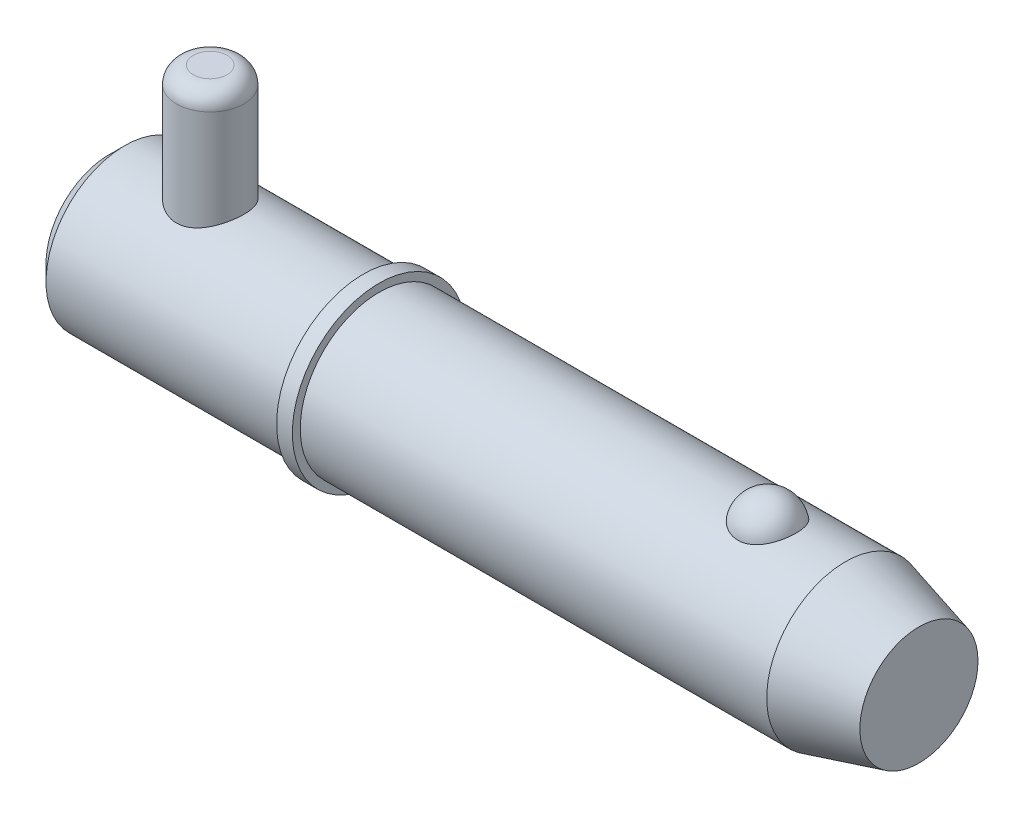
ISO-10303-21;
HEADER;
FILE_DESCRIPTION(('STEP AP214'),'2;1');
FILE_NAME('part.step','',(''),(''),'','','');
FILE_SCHEMA(('AUTOMOTIVE_DESIGN { 1 0 10303 214 1 1 1 1 }'));
ENDSEC;
DATA;
#1=APPLICATION_CONTEXT('core data for automotive mechanical design processes');
#2=APPLICATION_PROTOCOL_DEFINITION('international standard','automotive_design',2000,#1);
#3=PRODUCT_CONTEXT('',#1,'mechanical');
#4=PRODUCT('Part','Part','',(#3));
#5=PRODUCT_RELATED_PRODUCT_CATEGORY('part','',(#4));
#6=PRODUCT_DEFINITION_FORMATION('','',#4);
#7=PRODUCT_DEFINITION_CONTEXT('part definition',#1,'design');
#8=PRODUCT_DEFINITION('design','',#6,#7);
#9=PRODUCT_DEFINITION_SHAPE('','',#8);
#10=(LENGTH_UNIT() NAMED_UNIT(*) SI_UNIT(.MILLI.,.METRE.));
#11=(NAMED_UNIT(*) PLANE_ANGLE_UNIT() SI_UNIT($,.RADIAN.));
#12=(NAMED_UNIT(*) SI_UNIT($,.STERADIAN.) SOLID_ANGLE_UNIT());
#13=UNCERTAINTY_MEASURE_WITH_UNIT(LENGTH_MEASURE(1.E-05),#10,'distance_accuracy_value','');
#14=(GEOMETRIC_REPRESENTATION_CONTEXT(3) GLOBAL_UNCERTAINTY_ASSIGNED_CONTEXT((#13)) GLOBAL_UNIT_ASSIGNED_CONTEXT((#10,
#11,#12)) REPRESENTATION_CONTEXT('',''));
#15=CARTESIAN_POINT('',(0.,0.,0.));
#16=DIRECTION('',(0.,0.,1.));
#17=DIRECTION('',(1.,0.,0.));
#18=AXIS2_PLACEMENT_3D('',#15,#16,#17);
#19=CARTESIAN_POINT('',(14.28,26.985,0.));
#20=DIRECTION('',(0.,-1.,0.));
#21=DIRECTION('',(0.,0.,-1.));
#22=AXIS2_PLACEMENT_3D('',#19,#20,#21);
#23=CYLINDRICAL_SURFACE('',#22,4.76);
#24=CARTESIAN_POINT('',(14.28,-8.73500000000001,0.));
#25=DIRECTION('',(0.,1.,0.));
#26=DIRECTION('',(0.,0.,1.));
#27=AXIS2_PLACEMENT_3D('',#24,#25,#26);
#28=CIRCLE('',#27,4.76);
#29=CARTESIAN_POINT('',(14.28,-8.73500000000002,-4.76));
#30=VERTEX_POINT('',#29);
#31=EDGE_CURVE('P0_E25',#30,#30,#28,.T.);
#32=CARTESIAN_POINT('',(14.28,24.605,0.));
#33=DIRECTION('',(0.,1.,0.));
#34=DIRECTION('',(0.,0.,1.));
#35=AXIS2_PLACEMENT_3D('',#32,#33,#34);
#36=CIRCLE('',#35,4.76);
#37=CARTESIAN_POINT('',(14.28,24.605,-4.76));
#38=VERTEX_POINT('',#37);
#39=EDGE_CURVE('P0_E29',#38,#38,#36,.F.);
#40=CARTESIAN_POINT('',(14.28,-8.73500000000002,-4.76));
#41=CARTESIAN_POINT('',(14.28,-8.38770833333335,-4.76));
#42=CARTESIAN_POINT('',(14.28,-8.04041666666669,-4.76));
#43=CARTESIAN_POINT('',(14.28,-7.34583333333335,-4.76));
#44=CARTESIAN_POINT('',(14.28,-6.99854166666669,-4.76));
#45=CARTESIAN_POINT('',(14.28,-6.30395833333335,-4.76));
#46=CARTESIAN_POINT('',(14.28,-5.95666666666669,-4.76));
#47=CARTESIAN_POINT('',(14.28,-5.26208333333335,-4.76));
#48=CARTESIAN_POINT('',(14.28,-4.91479166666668,-4.76));
#49=CARTESIAN_POINT('',(14.28,-4.22020833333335,-4.76));
#50=CARTESIAN_POINT('',(14.28,-3.87291666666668,-4.76));
#51=CARTESIAN_POINT('',(14.28,-3.17833333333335,-4.76));
#52=CARTESIAN_POINT('',(14.28,-2.83104166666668,-4.76));
#53=CARTESIAN_POINT('',(14.28,-2.13645833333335,-4.76));
#54=CARTESIAN_POINT('',(14.28,-1.78916666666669,-4.76));
#55=CARTESIAN_POINT('',(14.28,-1.09458333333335,-4.76));
#56=CARTESIAN_POINT('',(14.28,-0.747291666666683,-4.76));
#57=CARTESIAN_POINT('',(14.28,-0.052708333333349,-4.76));
#58=CARTESIAN_POINT('',(14.28,0.294583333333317,-4.76));
#59=CARTESIAN_POINT('',(14.28,0.989166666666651,-4.76));
#60=CARTESIAN_POINT('',(14.28,1.33645833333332,-4.76));
#61=CARTESIAN_POINT('',(14.28,2.03104166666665,-4.76));
#62=CARTESIAN_POINT('',(14.28,2.37833333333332,-4.76));
#63=CARTESIAN_POINT('',(14.28,3.07291666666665,-4.76));
#64=CARTESIAN_POINT('',(14.28,3.42020833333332,-4.76));
#65=CARTESIAN_POINT('',(14.28,4.11479166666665,-4.76));
#66=CARTESIAN_POINT('',(14.28,4.46208333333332,-4.76));
#67=CARTESIAN_POINT('',(14.28,5.15666666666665,-4.76));
#68=CARTESIAN_POINT('',(14.28,5.50395833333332,-4.76));
#69=CARTESIAN_POINT('',(14.28,6.19854166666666,-4.76));
#70=CARTESIAN_POINT('',(14.28,6.54583333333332,-4.76));
#71=CARTESIAN_POINT('',(14.28,7.24041666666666,-4.76));
#72=CARTESIAN_POINT('',(14.28,7.58770833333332,-4.76));
#73=CARTESIAN_POINT('',(14.28,8.28229166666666,-4.76));
#74=CARTESIAN_POINT('',(14.28,8.62958333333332,-4.76));
#75=CARTESIAN_POINT('',(14.28,9.32416666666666,-4.76));
#76=CARTESIAN_POINT('',(14.28,9.67145833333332,-4.76));
#77=CARTESIAN_POINT('',(14.28,10.3660416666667,-4.76));
#78=CARTESIAN_POINT('',(14.28,10.7133333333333,-4.76));
#79=CARTESIAN_POINT('',(14.28,11.4079166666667,-4.76));
#80=CARTESIAN_POINT('',(14.28,11.7552083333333,-4.76));
#81=CARTESIAN_POINT('',(14.28,12.4497916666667,-4.76));
#82=CARTESIAN_POINT('',(14.28,12.7970833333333,-4.76));
#83=CARTESIAN_POINT('',(14.28,13.4916666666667,-4.76));
#84=CARTESIAN_POINT('',(14.28,13.8389583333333,-4.76));
#85=CARTESIAN_POINT('',(14.28,14.5335416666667,-4.76));
#86=CARTESIAN_POINT('',(14.28,14.8808333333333,-4.76));
#87=CARTESIAN_POINT('',(14.28,15.5754166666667,-4.76));
#88=CARTESIAN_POINT('',(14.28,15.9227083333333,-4.76));
#89=CARTESIAN_POINT('',(14.28,16.6172916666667,-4.76));
#90=CARTESIAN_POINT('',(14.28,16.9645833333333,-4.76));
#91=CARTESIAN_POINT('',(14.28,17.6591666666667,-4.76));
#92=CARTESIAN_POINT('',(14.28,18.0064583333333,-4.76));
#93=CARTESIAN_POINT('',(14.28,18.7010416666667,-4.76));
#94=CARTESIAN_POINT('',(14.28,19.0483333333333,-4.76));
#95=CARTESIAN_POINT('',(14.28,19.7429166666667,-4.76));
#96=CARTESIAN_POINT('',(14.28,20.0902083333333,-4.76));
#97=CARTESIAN_POINT('',(14.28,20.7847916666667,-4.76));
#98=CARTESIAN_POINT('',(14.28,21.1320833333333,-4.76));
#99=CARTESIAN_POINT('',(14.28,21.8266666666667,-4.76));
#100=CARTESIAN_POINT('',(14.28,22.1739583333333,-4.76));
#101=CARTESIAN_POINT('',(14.28,22.8685416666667,-4.76));
#102=CARTESIAN_POINT('',(14.28,23.2158333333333,-4.76));
#103=CARTESIAN_POINT('',(14.28,23.9104166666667,-4.76));
#104=CARTESIAN_POINT('',(14.28,24.2577083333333,-4.76));
#105=CARTESIAN_POINT('',(14.28,24.605,-4.76));
#106=B_SPLINE_CURVE_WITH_KNOTS('',3,(#40,#41,#42,#43,#44,#45,#46,#47,#48,#49,#50,#51,#52,#53,
#54,#55,#56,#57,#58,#59,#60,#61,#62,#63,#64,#65,#66,#67,#68,#69,#70,#71,#72,#73,#74,#75,#76,#77,
#78,#79,#80,#81,#82,#83,#84,#85,#86,#87,#88,#89,#90,#91,#92,#93,#94,#95,#96,#97,#98,#99,#100,
#101,#102,#103,#104,#105),.UNSPECIFIED.,.F.,.F.,(4,2,2,2,2,2,2,2,2,2,2,2,2,2,2,2,2,2,2,2,2,2,2,
2,2,2,2,2,2,2,2,2,4),(0.,1.041875,2.08375,3.125625,4.1675,5.209375,6.25125,7.293125,
8.33500000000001,9.376875,10.41875,11.460625,12.5025,13.544375,14.58625,15.628125,16.67,
17.711875,18.75375,19.795625,20.8375,21.879375,22.92125,23.963125,25.005,26.046875,27.08875,
28.130625,29.1725,30.214375,31.25625,32.298125,33.34),.UNSPECIFIED.);
#107=EDGE_CURVE('P0_BSEAM14',#30,#38,#106,.T.);
#108=ORIENTED_EDGE('',*,*,#31,.T.);
#109=ORIENTED_EDGE('',*,*,#39,.T.);
#110=ORIENTED_EDGE('',*,*,#107,.T.);
#111=ORIENTED_EDGE('',*,*,#107,.F.);
#112=EDGE_LOOP('',(#108,#110,#109,#111));
#113=FACE_BOUND('',#112,.T.);
#114=ADVANCED_FACE('P0_F14',(#113),#23,.T.);
#115=CARTESIAN_POINT('',(14.28,26.985,0.));
#116=DIRECTION('',(0.,1.,0.));
#117=DIRECTION('',(0.,0.,1.));
#118=AXIS2_PLACEMENT_3D('',#115,#116,#117);
#119=PLANE('',#118);
#120=CARTESIAN_POINT('',(14.28,26.985,0.));
#121=DIRECTION('',(0.,1.,0.));
#122=DIRECTION('',(0.,0.,1.));
#123=AXIS2_PLACEMENT_3D('',#120,#121,#122);
#124=CIRCLE('',#123,2.38);
#125=CARTESIAN_POINT('',(14.28,26.985,2.38));
#126=VERTEX_POINT('',#125);
#127=EDGE_CURVE('P0_E10',#126,#126,#124,.T.);
#128=ORIENTED_EDGE('',*,*,#127,.T.);
#129=EDGE_LOOP('',(#128));
#130=FACE_BOUND('',#129,.T.);
#131=ADVANCED_FACE('P0_F46',(#130),#119,.T.);
#132=CARTESIAN_POINT('',(14.28,-11.115,0.));
#133=DIRECTION('',(0.,1.,0.));
#134=DIRECTION('',(0.,0.,1.));
#135=AXIS2_PLACEMENT_3D('',#132,#133,#134);
#136=PLANE('',#135);
#137=CARTESIAN_POINT('',(14.28,-11.115,0.));
#138=DIRECTION('',(0.,1.,0.));
#139=DIRECTION('',(0.,0.,1.));
#140=AXIS2_PLACEMENT_3D('',#137,#138,#139);
#141=CIRCLE('',#140,2.38);
#142=CARTESIAN_POINT('',(14.28,-11.115,2.38));
#143=VERTEX_POINT('',#142);
#144=EDGE_CURVE('P0_E21',#143,#143,#141,.F.);
#145=ORIENTED_EDGE('',*,*,#144,.T.);
#146=EDGE_LOOP('',(#145));
#147=FACE_BOUND('',#146,.T.);
#148=ADVANCED_FACE('P0_F43',(#147),#136,.F.);
#149=CARTESIAN_POINT('',(14.28,-8.735,0.));
#150=DIRECTION('',(0.,1.,0.));
#151=DIRECTION('',(0.,0.,1.));
#152=AXIS2_PLACEMENT_3D('',#149,#150,#151);
#153=DEGENERATE_TOROIDAL_SURFACE('',#152,2.38,2.38,.T.);
#154=ORIENTED_EDGE('',*,*,#144,.F.);
#155=EDGE_LOOP('',(#154));
#156=FACE_BOUND('',#155,.T.);
#157=ORIENTED_EDGE('',*,*,#31,.F.);
#158=EDGE_LOOP('',(#157));
#159=FACE_BOUND('',#158,.T.);
#160=ADVANCED_FACE('P0_F38',(#156,#159),#153,.T.);
#161=CARTESIAN_POINT('',(14.28,24.605,0.));
#162=DIRECTION('',(0.,1.,0.));
#163=DIRECTION('',(0.,0.,1.));
#164=AXIS2_PLACEMENT_3D('',#161,#162,#163);
#165=DEGENERATE_TOROIDAL_SURFACE('',#164,2.38,2.38,.T.);
#166=ORIENTED_EDGE('',*,*,#39,.F.);
#167=EDGE_LOOP('',(#166));
#168=FACE_BOUND('',#167,.T.);
#169=ORIENTED_EDGE('',*,*,#127,.F.);
#170=EDGE_LOOP('',(#169));
#171=FACE_BOUND('',#170,.T.);
#172=ADVANCED_FACE('P0_F16',(#168,#171),#165,.T.);
#173=CLOSED_SHELL('',(#114,#131,#148,#160,#172));
#174=MANIFOLD_SOLID_BREP('P0_B1',#173);
#175=CARTESIAN_POINT('',(0.,0.,0.));
#176=DIRECTION('',(1.,0.,0.));
#177=DIRECTION('',(0.,0.,-1.));
#178=AXIS2_PLACEMENT_3D('',#175,#176,#177);
#179=CYLINDRICAL_SURFACE('',#178,11.115);
#180=CARTESIAN_POINT('',(103.929563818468,0.,0.));
#181=DIRECTION('',(1.,0.,0.));
#182=DIRECTION('',(0.,0.,-1.));
#183=AXIS2_PLACEMENT_3D('',#180,#181,#182);
#184=CIRCLE('',#183,11.115);
#185=CARTESIAN_POINT('',(103.929563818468,0.,-11.115));
#186=VERTEX_POINT('',#185);
#187=EDGE_CURVE('P1_E81',#186,#186,#184,.T.);
#188=ORIENTED_EDGE('',*,*,#187,.F.);
#189=EDGE_LOOP('',(#188));
#190=FACE_BOUND('',#189,.T.);
#191=CARTESIAN_POINT('',(38.1,0.,0.));
#192=DIRECTION('',(1.,0.,0.));
#193=DIRECTION('',(0.,0.,-1.));
#194=AXIS2_PLACEMENT_3D('',#191,#192,#193);
#195=CIRCLE('',#194,11.115);
#196=CARTESIAN_POINT('',(38.1,0.,-11.115));
#197=VERTEX_POINT('',#196);
#198=EDGE_CURVE('P1_E85',#197,#197,#195,.T.);
#199=ORIENTED_EDGE('',*,*,#198,.T.);
#200=EDGE_LOOP('',(#199));
#201=FACE_BOUND('',#200,.T.);
#202=CARTESIAN_POINT('',(92.9310680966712,10.3028087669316,4.17077409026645));
#203=CARTESIAN_POINT('',(92.7147756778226,10.3028003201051,4.17078240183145));
#204=CARTESIAN_POINT('',(92.4985488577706,10.3098895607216,4.15340593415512));
#205=CARTESIAN_POINT('',(92.0725408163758,10.3373834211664,4.08449540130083));
#206=CARTESIAN_POINT('',(91.8627577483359,10.3577841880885,4.03297121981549));
#207=CARTESIAN_POINT('',(91.4557825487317,10.4095237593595,3.89746513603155));
#208=CARTESIAN_POINT('',(91.2585726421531,10.4408466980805,3.81353029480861));
#209=CARTESIAN_POINT('',(90.8813382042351,10.5110236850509,3.61560339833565));
#210=CARTESIAN_POINT('',(90.7013171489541,10.5498792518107,3.50160528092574));
#211=CARTESIAN_POINT('',(90.3576842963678,10.6322884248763,3.24292464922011));
#212=CARTESIAN_POINT('',(90.1946861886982,10.6759443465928,3.09746040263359));
#213=CARTESIAN_POINT('',(89.8945911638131,10.7625291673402,2.78171925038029));
#214=CARTESIAN_POINT('',(89.7574990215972,10.8054579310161,2.61143778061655));
#215=CARTESIAN_POINT('',(89.5064084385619,10.8881935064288,2.24226695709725));
#216=CARTESIAN_POINT('',(89.3937105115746,10.9277761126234,2.04244123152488));
#217=CARTESIAN_POINT('',(89.2017771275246,10.997484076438,1.62578254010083));
#218=CARTESIAN_POINT('',(89.1225446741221,11.0276085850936,1.40894804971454));
#219=CARTESIAN_POINT('',(88.9983034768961,11.0756732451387,0.961250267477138));
#220=CARTESIAN_POINT('',(88.953760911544,11.0934470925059,0.730239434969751));
#221=CARTESIAN_POINT('',(88.9015695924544,11.1143331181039,0.263439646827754));
#222=CARTESIAN_POINT('',(88.8939200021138,11.1174456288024,0.0276507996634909));
#223=CARTESIAN_POINT('',(88.9156105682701,11.1087161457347,-0.440729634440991));
#224=CARTESIAN_POINT('',(88.9447624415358,11.0969502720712,-0.673331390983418));
#225=CARTESIAN_POINT('',(89.0391432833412,11.0597872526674,-1.12996621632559));
#226=CARTESIAN_POINT('',(89.1043729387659,11.0343898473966,-1.35399912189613));
#227=CARTESIAN_POINT('',(89.2696984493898,10.972515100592,-1.78750286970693));
#228=CARTESIAN_POINT('',(89.3698386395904,10.9360236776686,-1.99695478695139));
#229=CARTESIAN_POINT('',(89.6029408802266,10.8557595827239,-2.3952066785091));
#230=CARTESIAN_POINT('',(89.7359054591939,10.8119863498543,-2.5840050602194));
#231=CARTESIAN_POINT('',(90.032407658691,10.7216733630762,-2.93635726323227));
#232=CARTESIAN_POINT('',(90.1960565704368,10.675123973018,-3.09981510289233));
#233=CARTESIAN_POINT('',(90.5498601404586,10.5846571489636,-3.39592247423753));
#234=CARTESIAN_POINT('',(90.7400123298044,10.5407394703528,-3.52857487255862));
#235=CARTESIAN_POINT('',(91.1375014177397,10.4616690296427,-3.75646057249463));
#236=CARTESIAN_POINT('',(91.3443670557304,10.4263443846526,-3.85245432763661));
#237=CARTESIAN_POINT('',(91.7729541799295,10.3675574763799,-4.00798747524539));
#238=CARTESIAN_POINT('',(91.994670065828,10.3440907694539,-4.06754052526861));
#239=CARTESIAN_POINT('',(92.4346695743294,10.3128282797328,-4.14614314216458));
#240=CARTESIAN_POINT('',(92.6525654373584,10.3043040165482,-4.1670783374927));
#241=CARTESIAN_POINT('',(93.08894951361,10.3016771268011,-4.17357158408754));
#242=CARTESIAN_POINT('',(93.3074376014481,10.3075716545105,-4.15913661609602));
#243=CARTESIAN_POINT('',(93.7317442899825,10.3326686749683,-4.09636961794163));
#244=CARTESIAN_POINT('',(93.9377458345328,10.3514555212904,-4.0490957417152));
#245=CARTESIAN_POINT('',(94.3385764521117,10.399818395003,-3.92320197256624));
#246=CARTESIAN_POINT('',(94.5334046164,10.4293952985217,-3.84457953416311));
#247=CARTESIAN_POINT('',(94.9111917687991,10.4969600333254,-3.65612410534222));
#248=CARTESIAN_POINT('',(95.0937974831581,10.5351178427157,-3.54564545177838));
#249=CARTESIAN_POINT('',(95.4382040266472,10.6154999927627,-3.29718036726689));
#250=CARTESIAN_POINT('',(95.600000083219,10.657725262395,-3.15918764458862));
#251=CARTESIAN_POINT('',(95.9069596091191,10.744212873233,-2.85163580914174));
#252=CARTESIAN_POINT('',(96.0508919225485,10.7884718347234,-2.68084605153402));
#253=CARTESIAN_POINT('',(96.3092371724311,10.872374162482,-2.3172186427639));
#254=CARTESIAN_POINT('',(96.4236448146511,10.9120167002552,-2.12437704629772));
#255=CARTESIAN_POINT('',(96.6238739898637,10.9838919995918,-1.71516999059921));
#256=CARTESIAN_POINT('',(96.7086617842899,11.0158465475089,-1.49824866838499));
#257=CARTESIAN_POINT('',(96.8426838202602,11.0673523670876,-1.05228572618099));
#258=CARTESIAN_POINT('',(96.8919174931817,11.086903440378,-0.823243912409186));
#259=CARTESIAN_POINT('',(96.9538915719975,11.1116323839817,-0.359087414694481));
#260=CARTESIAN_POINT('',(96.9665662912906,11.1167843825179,-0.123962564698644));
#261=CARTESIAN_POINT('',(96.954973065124,11.1121144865,0.345220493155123));
#262=CARTESIAN_POINT('',(96.9307056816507,11.1022928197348,0.579278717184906));
#263=CARTESIAN_POINT('',(96.8459073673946,11.0687504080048,1.03866534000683));
#264=CARTESIAN_POINT('',(96.7855299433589,11.0450885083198,1.26402641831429));
#265=CARTESIAN_POINT('',(96.6298532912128,10.9863185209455,1.70076772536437));
#266=CARTESIAN_POINT('',(96.534551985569,10.9512097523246,1.91214712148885));
#267=CARTESIAN_POINT('',(96.3103974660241,10.8729733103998,2.31608359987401));
#268=CARTESIAN_POINT('',(96.1813806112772,10.8298068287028,2.50854240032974));
#269=CARTESIAN_POINT('',(95.8927327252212,10.7401896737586,2.86808766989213));
#270=CARTESIAN_POINT('',(95.7331022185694,10.6937390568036,3.03517457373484));
#271=CARTESIAN_POINT('',(95.3875341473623,10.6029321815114,3.33857581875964));
#272=CARTESIAN_POINT('',(95.2017089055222,10.5585680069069,3.47501541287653));
#273=CARTESIAN_POINT('',(94.8078750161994,10.4769321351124,3.71390897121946));
#274=CARTESIAN_POINT('',(94.5998635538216,10.439661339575,3.81635861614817));
#275=CARTESIAN_POINT('',(94.1540666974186,10.3749407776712,3.98910631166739));
#276=CARTESIAN_POINT('',(93.9152342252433,10.3482457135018,4.05700929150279));
#277=CARTESIAN_POINT('',(93.4279254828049,10.312188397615,4.14782844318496));
#278=CARTESIAN_POINT('',(93.1794535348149,10.3028184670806,4.17076454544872));
#279=CARTESIAN_POINT('',(92.9310680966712,10.3028087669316,4.17077409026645));
#280=B_SPLINE_CURVE_WITH_KNOTS('',3,(#202,#203,#204,#205,#206,#207,#208,#209,#210,#211,#212,
#213,#214,#215,#216,#217,#218,#219,#220,#221,#222,#223,#224,#225,#226,#227,#228,#229,#230,#231,
#232,#233,#234,#235,#236,#237,#238,#239,#240,#241,#242,#243,#244,#245,#246,#247,#248,#249,#250,
#251,#252,#253,#254,#255,#256,#257,#258,#259,#260,#261,#262,#263,#264,#265,#266,#267,#268,#269,
#270,#271,#272,#273,#274,#275,#276,#277,#278,#279),.UNSPECIFIED.,.T.,.F.,(4,2,2,2,2,2,2,2,2,2,2,
2,2,2,2,2,2,2,2,2,2,2,2,2,2,2,2,2,2,2,2,2,2,2,2,2,2,2,4),(0.,0.647966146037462,1.29574482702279,
1.94258643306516,2.58955857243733,3.25496465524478,3.92049326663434,4.61566368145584,
5.31089647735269,6.01531821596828,6.71972398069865,7.42054043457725,8.12137023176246,
8.82309331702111,9.52487047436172,10.2292439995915,10.9335519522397,11.6223330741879,
12.3108558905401,12.9647664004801,13.6185478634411,14.2521847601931,14.8858731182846,
15.5334360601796,16.1811472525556,16.8611459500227,17.5412664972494,18.2431855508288,
18.9451158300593,19.6483065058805,20.3514864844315,21.0516982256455,21.7519516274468,
22.4556690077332,23.1593743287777,23.8601491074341,24.5610129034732,25.3054529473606,
26.049562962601),.UNSPECIFIED.);
#281=CARTESIAN_POINT('',(92.9310680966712,10.3028087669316,4.17077409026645));
#282=VERTEX_POINT('',#281);
#283=EDGE_CURVE('P1_E35',#282,#282,#280,.T.);
#284=ORIENTED_EDGE('',*,*,#283,.T.);
#285=EDGE_LOOP('',(#284));
#286=FACE_BOUND('',#285,.T.);
#287=ADVANCED_FACE('P1_F13',(#190,#201,#286),#179,.T.);
#288=CARTESIAN_POINT('',(0.,0.,0.));
#289=DIRECTION('',(-1.,0.,0.));
#290=DIRECTION('',(0.,0.,1.));
#291=AXIS2_PLACEMENT_3D('',#288,#289,#290);
#292=PLANE('',#291);
#293=CARTESIAN_POINT('',(0.,0.,0.));
#294=DIRECTION('',(1.,0.,0.));
#295=DIRECTION('',(0.,0.,-1.));
#296=AXIS2_PLACEMENT_3D('',#293,#294,#295);
#297=CIRCLE('',#296,8.892);
#298=CARTESIAN_POINT('',(0.,0.,-8.892));
#299=VERTEX_POINT('',#298);
#300=EDGE_CURVE('P1_E9',#299,#299,#297,.T.);
#301=ORIENTED_EDGE('',*,*,#300,.F.);
#302=EDGE_LOOP('',(#301));
#303=FACE_BOUND('',#302,.T.);
#304=ADVANCED_FACE('P1_F15',(#303),#292,.T.);
#305=CARTESIAN_POINT('',(2.22299999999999,0.,0.));
#306=DIRECTION('',(1.,0.,0.));
#307=DIRECTION('',(0.,0.,-1.));
#308=AXIS2_PLACEMENT_3D('',#305,#306,#307);
#309=CONICAL_SURFACE('',#308,11.115,0.78539816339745);
#310=ORIENTED_EDGE('',*,*,#300,.T.);
#311=EDGE_LOOP('',(#310));
#312=FACE_BOUND('',#311,.T.);
#313=CARTESIAN_POINT('',(2.22299999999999,0.,0.));
#314=DIRECTION('',(1.,0.,0.));
#315=DIRECTION('',(0.,0.,-1.));
#316=AXIS2_PLACEMENT_3D('',#313,#314,#315);
#317=CIRCLE('',#316,11.115);
#318=CARTESIAN_POINT('',(2.22299999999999,0.,-11.115));
#319=VERTEX_POINT('',#318);
#320=EDGE_CURVE('P1_E26',#319,#319,#317,.T.);
#321=ORIENTED_EDGE('',*,*,#320,.F.);
#322=EDGE_LOOP('',(#321));
#323=FACE_BOUND('',#322,.T.);
#324=ADVANCED_FACE('P1_F77',(#312,#323),#309,.T.);
#325=CARTESIAN_POINT('',(0.,0.,0.));
#326=DIRECTION('',(1.,0.,0.));
#327=DIRECTION('',(0.,0.,-1.));
#328=AXIS2_PLACEMENT_3D('',#325,#326,#327);
#329=CYLINDRICAL_SURFACE('',#328,11.115);
#330=CARTESIAN_POINT('',(14.28,-10.0441836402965,4.76));
#331=CARTESIAN_POINT('',(14.1533731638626,-10.0441846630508,4.75999904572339));
#332=CARTESIAN_POINT('',(14.0267055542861,-10.0465865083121,4.75493985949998));
#333=CARTESIAN_POINT('',(13.774298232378,-10.0561141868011,4.73475585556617));
#334=CARTESIAN_POINT('',(13.6485591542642,-10.0632429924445,4.71962470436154));
#335=CARTESIAN_POINT('',(13.3987500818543,-10.0819979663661,4.67942666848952));
#336=CARTESIAN_POINT('',(13.2746840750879,-10.0936334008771,4.65433930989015));
#337=CARTESIAN_POINT('',(13.0293244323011,-10.1210146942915,4.59449317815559));
#338=CARTESIAN_POINT('',(12.9080319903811,-10.1367622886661,4.55973032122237));
#339=CARTESIAN_POINT('',(12.669614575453,-10.1717810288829,4.48106435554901));
#340=CARTESIAN_POINT('',(12.5524727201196,-10.1910352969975,4.4372048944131));
#341=CARTESIAN_POINT('',(12.3224300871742,-10.2325403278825,4.34063417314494));
#342=CARTESIAN_POINT('',(12.2095309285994,-10.2547922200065,4.28791957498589));
#343=CARTESIAN_POINT('',(11.8782785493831,-10.3250879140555,4.11715127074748));
#344=CARTESIAN_POINT('',(11.6670799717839,-10.3767168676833,3.98637638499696));
#345=CARTESIAN_POINT('',(11.2564039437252,-10.4874309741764,3.68567149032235));
#346=CARTESIAN_POINT('',(11.0583793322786,-10.5467772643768,3.51386978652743));
#347=CARTESIAN_POINT('',(10.6927724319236,-10.6641377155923,3.13969960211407));
#348=CARTESIAN_POINT('',(10.5252022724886,-10.7221513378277,2.93731900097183));
#349=CARTESIAN_POINT('',(10.2965609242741,-10.8050020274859,2.60935726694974));
#350=CARTESIAN_POINT('',(10.2227768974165,-10.8324811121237,2.49310321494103));
#351=CARTESIAN_POINT('',(10.0853380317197,-10.884703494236,2.25418999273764));
#352=CARTESIAN_POINT('',(10.0216789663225,-10.9094479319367,2.13153352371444));
#353=CARTESIAN_POINT('',(9.90506238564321,-10.9554932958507,1.88060370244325));
#354=CARTESIAN_POINT('',(9.85210574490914,-10.9767939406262,1.7523298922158));
#355=CARTESIAN_POINT('',(9.75746464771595,-11.0153112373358,1.49115740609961));
#356=CARTESIAN_POINT('',(9.71577447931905,-11.0325299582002,1.35826111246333));
#357=CARTESIAN_POINT('',(9.64605475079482,-11.0615607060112,1.09614539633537));
#358=CARTESIAN_POINT('',(9.61740732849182,-11.0736151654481,0.96711700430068));
#359=CARTESIAN_POINT('',(9.57092026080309,-11.0932687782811,0.706847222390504));
#360=CARTESIAN_POINT('',(9.55307574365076,-11.1008699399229,0.575606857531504));
#361=CARTESIAN_POINT('',(9.52838640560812,-11.1114054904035,0.31192917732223));
#362=CARTESIAN_POINT('',(9.52153986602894,-11.114340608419,0.179492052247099));
#363=CARTESIAN_POINT('',(9.51892405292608,-11.1154607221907,-0.0855090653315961));
#364=CARTESIAN_POINT('',(9.52315432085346,-11.1136459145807,-0.218073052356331));
#365=CARTESIAN_POINT('',(9.542009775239,-11.1055891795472,-0.473709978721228));
#366=CARTESIAN_POINT('',(9.55594693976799,-11.099640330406,-0.596843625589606));
#367=CARTESIAN_POINT('',(9.59332832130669,-11.0837823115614,-0.841440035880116));
#368=CARTESIAN_POINT('',(9.61677567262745,-11.0738718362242,-0.962902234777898));
#369=CARTESIAN_POINT('',(9.67294089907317,-11.0503378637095,-1.20325684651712));
#370=CARTESIAN_POINT('',(9.70565569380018,-11.0367156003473,-1.32215009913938));
#371=CARTESIAN_POINT('',(9.78005008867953,-11.0060908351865,-1.55666640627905));
#372=CARTESIAN_POINT('',(9.82173311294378,-10.9890870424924,-1.67228819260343));
#373=CARTESIAN_POINT('',(9.96110379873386,-10.9330280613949,-2.01656166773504));
#374=CARTESIAN_POINT('',(10.0722987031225,-10.8892801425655,-2.23915547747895));
#375=CARTESIAN_POINT('',(10.3268588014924,-10.7934745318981,-2.66299199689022));
#376=CARTESIAN_POINT('',(10.4702355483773,-10.7414138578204,-2.86422700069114));
#377=CARTESIAN_POINT('',(10.7973904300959,-10.6296201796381,-3.25557775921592));
#378=CARTESIAN_POINT('',(10.9833705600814,-10.569604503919,-3.443774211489));
#379=CARTESIAN_POINT('',(11.3844486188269,-10.4514707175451,-3.78722133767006));
#380=CARTESIAN_POINT('',(11.5995590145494,-10.3933534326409,-3.94245783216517));
#381=CARTESIAN_POINT('',(11.9444340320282,-10.311516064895,-4.14990014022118));
#382=CARTESIAN_POINT('',(12.0654579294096,-10.2847012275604,-4.21573894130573));
#383=CARTESIAN_POINT('',(12.3132718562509,-10.2342051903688,-4.33688518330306));
#384=CARTESIAN_POINT('',(12.4400593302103,-10.2105226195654,-4.39219723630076));
#385=CARTESIAN_POINT('',(12.6985418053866,-10.1671237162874,-4.49174500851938));
#386=CARTESIAN_POINT('',(12.8302359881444,-10.1474067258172,-4.53598256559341));
#387=CARTESIAN_POINT('',(13.0975061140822,-10.1126841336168,-4.61287629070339));
#388=CARTESIAN_POINT('',(13.233079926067,-10.0976759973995,-4.64553869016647));
#389=CARTESIAN_POINT('',(13.4978553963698,-10.0737863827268,-4.6971059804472));
#390=CARTESIAN_POINT('',(13.6268754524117,-10.0645618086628,-4.716785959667));
#391=CARTESIAN_POINT('',(13.8862990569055,-10.051062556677,-4.74548419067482));
#392=CARTESIAN_POINT('',(14.0167019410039,-10.0467856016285,-4.75450734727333));
#393=CARTESIAN_POINT('',(14.277859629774,-10.0433352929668,-4.76179143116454));
#394=CARTESIAN_POINT('',(14.4086143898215,-10.0441613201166,-4.76005366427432));
#395=CARTESIAN_POINT('',(14.6694025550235,-10.0508838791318,-4.74584231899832));
#396=CARTESIAN_POINT('',(14.7994359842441,-10.0567802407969,-4.73336910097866));
#397=CARTESIAN_POINT('',(15.0487369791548,-10.0728449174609,-4.69907984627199));
#398=CARTESIAN_POINT('',(15.1681238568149,-10.0826872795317,-4.67797462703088));
#399=CARTESIAN_POINT('',(15.4045894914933,-10.1062580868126,-4.62682977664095));
#400=CARTESIAN_POINT('',(15.5216674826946,-10.1199877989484,-4.59678723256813));
#401=CARTESIAN_POINT('',(15.868278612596,-10.1664161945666,-4.49365911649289));
#402=CARTESIAN_POINT('',(16.0933756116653,-10.2043671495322,-4.40754694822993));
#403=CARTESIAN_POINT('',(16.5357981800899,-10.2919879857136,-4.19898201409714));
#404=CARTESIAN_POINT('',(16.7523611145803,-10.3420954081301,-4.07511281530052));
#405=CARTESIAN_POINT('',(17.1627188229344,-10.4477911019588,-3.7959429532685));
#406=CARTESIAN_POINT('',(17.3565033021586,-10.5033818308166,-3.64062816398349));
#407=CARTESIAN_POINT('',(17.7334034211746,-10.6196376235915,-3.28693729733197));
#408=CARTESIAN_POINT('',(17.9141276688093,-10.6803237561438,-3.08599175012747));
#409=CARTESIAN_POINT('',(18.1582189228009,-10.7666348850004,-2.76320365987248));
#410=CARTESIAN_POINT('',(18.2351223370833,-10.7946346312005,-2.65197124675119));
#411=CARTESIAN_POINT('',(18.3793967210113,-10.8483267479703,-2.42297927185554));
#412=CARTESIAN_POINT('',(18.4467718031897,-10.87402011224,-2.30522255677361));
#413=CARTESIAN_POINT('',(18.5717669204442,-10.9225249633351,-2.06324665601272));
#414=CARTESIAN_POINT('',(18.6293326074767,-10.9453202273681,-1.93899615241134));
#415=CARTESIAN_POINT('',(18.73370006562,-10.9872100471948,-1.6855059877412));
#416=CARTESIAN_POINT('',(18.7805065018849,-11.0063062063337,-1.55626851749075));
#417=CARTESIAN_POINT('',(18.8628731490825,-11.0402419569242,-1.29375150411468));
#418=CARTESIAN_POINT('',(18.8984366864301,-11.0550828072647,-1.16047316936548));
#419=CARTESIAN_POINT('',(18.9579183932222,-11.0800638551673,-0.890912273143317));
#420=CARTESIAN_POINT('',(18.9818374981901,-11.0902044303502,-0.75462995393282));
#421=CARTESIAN_POINT('',(19.0164177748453,-11.104911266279,-0.490295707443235));
#422=CARTESIAN_POINT('',(19.027922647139,-11.1098318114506,-0.362373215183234));
#423=CARTESIAN_POINT('',(19.040554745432,-11.1152360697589,-0.105876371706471));
#424=CARTESIAN_POINT('',(19.0416784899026,-11.1157182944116,0.0226981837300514));
#425=CARTESIAN_POINT('',(19.0335275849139,-11.1122291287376,0.27938352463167));
#426=CARTESIAN_POINT('',(19.0242587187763,-11.1082602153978,0.407494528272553));
#427=CARTESIAN_POINT('',(18.9954320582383,-11.0959792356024,0.662388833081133));
#428=CARTESIAN_POINT('',(18.9758704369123,-11.0876655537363,0.789171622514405));
#429=CARTESIAN_POINT('',(18.9276379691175,-11.0673259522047,1.03545890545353));
#430=CARTESIAN_POINT('',(18.8993573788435,-11.0554596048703,1.15505309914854));
#431=CARTESIAN_POINT('',(18.8337694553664,-11.0282166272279,1.39134516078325));
#432=CARTESIAN_POINT('',(18.7964589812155,-11.0128387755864,1.5080420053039));
#433=CARTESIAN_POINT('',(18.671464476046,-10.9619666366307,1.85262797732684));
#434=CARTESIAN_POINT('',(18.5706772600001,-10.9217161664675,2.07521484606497));
#435=CARTESIAN_POINT('',(18.33202463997,-10.8301378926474,2.51061719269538));
#436=CARTESIAN_POINT('',(18.1926775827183,-10.7783885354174,2.72252375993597));
#437=CARTESIAN_POINT('',(17.8829747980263,-10.669863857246,3.12088015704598));
#438=CARTESIAN_POINT('',(17.7126068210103,-10.6130865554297,3.30731987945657));
#439=CARTESIAN_POINT('',(17.3310036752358,-10.495668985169,3.66358491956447));
#440=CARTESIAN_POINT('',(17.1177010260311,-10.4350471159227,3.83122543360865));
#441=CARTESIAN_POINT('',(16.7778915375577,-10.3495418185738,4.05420569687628));
#442=CARTESIAN_POINT('',(16.6612023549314,-10.3219229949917,4.12383380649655));
#443=CARTESIAN_POINT('',(16.4218466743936,-10.2693487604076,4.25306463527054));
#444=CARTESIAN_POINT('',(16.2991829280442,-10.2443921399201,4.31267191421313));
#445=CARTESIAN_POINT('',(16.0488008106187,-10.1979981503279,4.42126071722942));
#446=CARTESIAN_POINT('',(15.9210894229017,-10.1765561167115,4.47025635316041));
#447=CARTESIAN_POINT('',(15.6613937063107,-10.1379191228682,4.55720152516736));
#448=CARTESIAN_POINT('',(15.5294115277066,-10.1207220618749,4.59515652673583));
#449=CARTESIAN_POINT('',(15.2624981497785,-10.091252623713,4.65951684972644));
#450=CARTESIAN_POINT('',(15.1275757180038,-10.0789672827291,4.68595259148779));
#451=CARTESIAN_POINT('',(14.8556442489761,-10.0597530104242,4.72706206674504));
#452=CARTESIAN_POINT('',(14.7186368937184,-10.0528199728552,4.74174481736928));
#453=CARTESIAN_POINT('',(14.5310955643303,-10.047196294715,4.75363843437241));
#454=CARTESIAN_POINT('',(14.48091543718,-10.0460674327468,4.75602323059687));
#455=CARTESIAN_POINT('',(14.3804923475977,-10.044560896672,4.7592042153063));
#456=CARTESIAN_POINT('',(14.3302493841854,-10.0441832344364,4.76000037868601));
#457=CARTESIAN_POINT('',(14.28,-10.0441836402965,4.76));
#458=B_SPLINE_CURVE_WITH_KNOTS('',3,(#330,#331,#332,#333,#334,#335,#336,#337,#338,#339,#340,
#341,#342,#343,#344,#345,#346,#347,#348,#349,#350,#351,#352,#353,#354,#355,#356,#357,#358,#359,
#360,#361,#362,#363,#364,#365,#366,#367,#368,#369,#370,#371,#372,#373,#374,#375,#376,#377,#378,
#379,#380,#381,#382,#383,#384,#385,#386,#387,#388,#389,#390,#391,#392,#393,#394,#395,#396,#397,
#398,#399,#400,#401,#402,#403,#404,#405,#406,#407,#408,#409,#410,#411,#412,#413,#414,#415,#416,
#417,#418,#419,#420,#421,#422,#423,#424,#425,#426,#427,#428,#429,#430,#431,#432,#433,#434,#435,
#436,#437,#438,#439,#440,#441,#442,#443,#444,#445,#446,#447,#448,#449,#450,#451,#452,#453,#454,
#455,#456,#457),.UNSPECIFIED.,.T.,.F.,(4,2,2,2,2,2,2,2,2,2,2,2,2,2,2,2,2,2,2,2,2,2,2,2,2,2,2,2,
2,2,2,2,2,2,2,2,2,2,2,2,2,2,2,2,2,2,2,2,2,2,2,2,2,2,2,2,2,2,2,2,2,2,2,4),(0.,0.379828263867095,
0.759895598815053,1.14074858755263,1.52176256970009,1.90098898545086,2.28035867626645,
3.03818035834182,3.84125131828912,4.6446414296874,5.06541657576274,5.48601561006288,
5.90664899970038,6.3270687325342,6.72470503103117,7.12216187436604,7.51955659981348,
7.91693487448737,8.28868404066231,8.66055582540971,9.03230414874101,9.40419465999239,
10.1585834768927,10.9132435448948,11.7236471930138,12.5343987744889,12.9550196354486,
13.3754557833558,13.7958221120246,14.2159617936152,14.6079540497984,14.9997658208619,
15.3915300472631,15.7832811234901,16.1477615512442,16.512360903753,17.240999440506,
18.0012974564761,18.761937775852,19.5886929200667,20.0025782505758,20.4162843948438,
20.832212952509,21.2479608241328,21.6635855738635,22.0791769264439,22.4642880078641,
22.8495282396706,23.2345541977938,23.6197234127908,23.9896813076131,24.3597680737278,
25.099327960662,25.8726239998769,26.6462260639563,27.4759193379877,27.8914891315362,
28.3068693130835,28.7216936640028,29.1363123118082,29.5498292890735,29.9630287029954,
30.113753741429,30.2644811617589),.UNSPECIFIED.);
#459=CARTESIAN_POINT('',(14.28,-10.0441836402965,4.76));
#460=VERTEX_POINT('',#459);
#461=EDGE_CURVE('P1_E17',#460,#460,#458,.T.);
#462=ORIENTED_EDGE('',*,*,#461,.F.);
#463=EDGE_LOOP('',(#462));
#464=FACE_BOUND('',#463,.T.);
#465=CARTESIAN_POINT('',(14.28,10.0441836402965,4.76));
#466=CARTESIAN_POINT('',(14.4066268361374,10.0441846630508,4.75999904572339));
#467=CARTESIAN_POINT('',(14.5332944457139,10.0465865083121,4.75493985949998));
#468=CARTESIAN_POINT('',(14.785701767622,10.0561141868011,4.73475585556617));
#469=CARTESIAN_POINT('',(14.9114408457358,10.0632429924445,4.71962470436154));
#470=CARTESIAN_POINT('',(15.1612499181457,10.0819979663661,4.67942666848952));
#471=CARTESIAN_POINT('',(15.2853159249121,10.0936334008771,4.65433930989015));
#472=CARTESIAN_POINT('',(15.5306755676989,10.1210146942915,4.59449317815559));
#473=CARTESIAN_POINT('',(15.6519680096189,10.1367622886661,4.55973032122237));
#474=CARTESIAN_POINT('',(15.890385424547,10.1717810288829,4.48106435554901));
#475=CARTESIAN_POINT('',(16.0075272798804,10.1910352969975,4.4372048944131));
#476=CARTESIAN_POINT('',(16.2375699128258,10.2325403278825,4.34063417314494));
#477=CARTESIAN_POINT('',(16.3504690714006,10.2547922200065,4.28791957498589));
#478=CARTESIAN_POINT('',(16.6817214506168,10.3250879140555,4.11715127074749));
#479=CARTESIAN_POINT('',(16.8929200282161,10.3767168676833,3.98637638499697));
#480=CARTESIAN_POINT('',(17.3035960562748,10.4874309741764,3.68567149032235));
#481=CARTESIAN_POINT('',(17.5016206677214,10.5467772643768,3.51386978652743));
#482=CARTESIAN_POINT('',(17.8672275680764,10.6641377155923,3.13969960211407));
#483=CARTESIAN_POINT('',(18.0347977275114,10.7221513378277,2.93731900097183));
#484=CARTESIAN_POINT('',(18.2634390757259,10.8050020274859,2.60935726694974));
#485=CARTESIAN_POINT('',(18.3372231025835,10.8324811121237,2.49310321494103));
#486=CARTESIAN_POINT('',(18.4746619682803,10.884703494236,2.25418999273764));
#487=CARTESIAN_POINT('',(18.5383210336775,10.9094479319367,2.13153352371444));
#488=CARTESIAN_POINT('',(18.6549376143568,10.9554932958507,1.88060370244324));
#489=CARTESIAN_POINT('',(18.7078942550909,10.9767939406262,1.75232989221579));
#490=CARTESIAN_POINT('',(18.8025353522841,11.0153112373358,1.4911574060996));
#491=CARTESIAN_POINT('',(18.844225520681,11.0325299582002,1.35826111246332));
#492=CARTESIAN_POINT('',(18.9139452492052,11.0615607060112,1.09614539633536));
#493=CARTESIAN_POINT('',(18.9425926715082,11.0736151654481,0.967117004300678));
#494=CARTESIAN_POINT('',(18.9890797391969,11.0932687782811,0.706847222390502));
#495=CARTESIAN_POINT('',(19.0069242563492,11.1008699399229,0.575606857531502));
#496=CARTESIAN_POINT('',(19.0316135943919,11.1114054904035,0.311929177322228));
#497=CARTESIAN_POINT('',(19.0384601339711,11.114340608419,0.179492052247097));
#498=CARTESIAN_POINT('',(19.0410759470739,11.1154607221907,-0.0855090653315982));
#499=CARTESIAN_POINT('',(19.0368456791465,11.1136459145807,-0.218073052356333));
#500=CARTESIAN_POINT('',(19.017990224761,11.1055891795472,-0.47370997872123));
#501=CARTESIAN_POINT('',(19.004053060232,11.099640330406,-0.596843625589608));
#502=CARTESIAN_POINT('',(18.9666716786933,11.0837823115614,-0.841440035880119));
#503=CARTESIAN_POINT('',(18.9432243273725,11.0738718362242,-0.9629022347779));
#504=CARTESIAN_POINT('',(18.8870591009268,11.0503378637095,-1.20325684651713));
#505=CARTESIAN_POINT('',(18.8543443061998,11.0367156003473,-1.32215009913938));
#506=CARTESIAN_POINT('',(18.7799499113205,11.0060908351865,-1.55666640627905));
#507=CARTESIAN_POINT('',(18.7382668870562,10.9890870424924,-1.67228819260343));
#508=CARTESIAN_POINT('',(18.5988962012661,10.9330280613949,-2.01656166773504));
#509=CARTESIAN_POINT('',(18.4877012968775,10.8892801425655,-2.23915547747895));
#510=CARTESIAN_POINT('',(18.2331411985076,10.7934745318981,-2.66299199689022));
#511=CARTESIAN_POINT('',(18.0897644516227,10.7414138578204,-2.86422700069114));
#512=CARTESIAN_POINT('',(17.7626095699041,10.6296201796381,-3.25557775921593));
#513=CARTESIAN_POINT('',(17.5766294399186,10.569604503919,-3.443774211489));
#514=CARTESIAN_POINT('',(17.1755513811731,10.4514707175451,-3.78722133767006));
#515=CARTESIAN_POINT('',(16.9604409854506,10.3933534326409,-3.94245783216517));
#516=CARTESIAN_POINT('',(16.6155659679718,10.311516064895,-4.14990014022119));
#517=CARTESIAN_POINT('',(16.4945420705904,10.2847012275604,-4.21573894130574));
#518=CARTESIAN_POINT('',(16.2467281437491,10.2342051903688,-4.33688518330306));
#519=CARTESIAN_POINT('',(16.1199406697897,10.2105226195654,-4.39219723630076));
#520=CARTESIAN_POINT('',(15.8614581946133,10.1671237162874,-4.49174500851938));
#521=CARTESIAN_POINT('',(15.7297640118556,10.1474067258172,-4.53598256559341));
#522=CARTESIAN_POINT('',(15.4624938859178,10.1126841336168,-4.61287629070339));
#523=CARTESIAN_POINT('',(15.326920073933,10.0976759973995,-4.64553869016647));
#524=CARTESIAN_POINT('',(15.0621446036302,10.0737863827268,-4.6971059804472));
#525=CARTESIAN_POINT('',(14.9331245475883,10.0645618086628,-4.716785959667));
#526=CARTESIAN_POINT('',(14.6737009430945,10.051062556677,-4.74548419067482));
#527=CARTESIAN_POINT('',(14.543298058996,10.0467856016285,-4.75450734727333));
#528=CARTESIAN_POINT('',(14.2821403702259,10.0433352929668,-4.76179143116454));
#529=CARTESIAN_POINT('',(14.1513856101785,10.0441613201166,-4.76005366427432));
#530=CARTESIAN_POINT('',(13.8905974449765,10.0508838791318,-4.74584231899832));
#531=CARTESIAN_POINT('',(13.7605640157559,10.0567802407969,-4.73336910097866));
#532=CARTESIAN_POINT('',(13.5112630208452,10.0728449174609,-4.69907984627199));
#533=CARTESIAN_POINT('',(13.3918761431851,10.0826872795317,-4.67797462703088));
#534=CARTESIAN_POINT('',(13.1554105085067,10.1062580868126,-4.62682977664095));
#535=CARTESIAN_POINT('',(13.0383325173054,10.1199877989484,-4.59678723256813));
#536=CARTESIAN_POINT('',(12.691721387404,10.1664161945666,-4.49365911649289));
#537=CARTESIAN_POINT('',(12.4666243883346,10.2043671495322,-4.40754694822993));
#538=CARTESIAN_POINT('',(12.0242018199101,10.2919879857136,-4.19898201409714));
#539=CARTESIAN_POINT('',(11.8076388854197,10.3420954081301,-4.07511281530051));
#540=CARTESIAN_POINT('',(11.3972811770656,10.4477911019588,-3.7959429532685));
#541=CARTESIAN_POINT('',(11.2034966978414,10.5033818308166,-3.64062816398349));
#542=CARTESIAN_POINT('',(10.8265965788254,10.6196376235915,-3.28693729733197));
#543=CARTESIAN_POINT('',(10.6458723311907,10.6803237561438,-3.08599175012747));
#544=CARTESIAN_POINT('',(10.4017810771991,10.7666348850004,-2.76320365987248));
#545=CARTESIAN_POINT('',(10.3248776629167,10.7946346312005,-2.65197124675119));
#546=CARTESIAN_POINT('',(10.1806032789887,10.8483267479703,-2.42297927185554));
#547=CARTESIAN_POINT('',(10.1132281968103,10.87402011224,-2.30522255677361));
#548=CARTESIAN_POINT('',(9.98823307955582,10.9225249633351,-2.06324665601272));
#549=CARTESIAN_POINT('',(9.93066739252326,10.9453202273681,-1.93899615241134));
#550=CARTESIAN_POINT('',(9.82629993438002,10.9872100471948,-1.6855059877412));
#551=CARTESIAN_POINT('',(9.77949349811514,11.0063062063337,-1.55626851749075));
#552=CARTESIAN_POINT('',(9.69712685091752,11.0402419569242,-1.29375150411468));
#553=CARTESIAN_POINT('',(9.66156331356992,11.0550828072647,-1.16047316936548));
#554=CARTESIAN_POINT('',(9.60208160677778,11.0800638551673,-0.890912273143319));
#555=CARTESIAN_POINT('',(9.57816250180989,11.0902044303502,-0.754629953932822));
#556=CARTESIAN_POINT('',(9.54358222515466,11.104911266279,-0.490295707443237));
#557=CARTESIAN_POINT('',(9.53207735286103,11.1098318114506,-0.362373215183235));
#558=CARTESIAN_POINT('',(9.51944525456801,11.1152360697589,-0.105876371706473));
#559=CARTESIAN_POINT('',(9.51832151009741,11.1157182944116,0.0226981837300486));
#560=CARTESIAN_POINT('',(9.52647241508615,11.1122291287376,0.279383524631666));
#561=CARTESIAN_POINT('',(9.53574128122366,11.1082602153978,0.407494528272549));
#562=CARTESIAN_POINT('',(9.5645679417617,11.0959792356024,0.662388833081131));
#563=CARTESIAN_POINT('',(9.58412956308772,11.0876655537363,0.789171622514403));
#564=CARTESIAN_POINT('',(9.63236203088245,11.0673259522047,1.03545890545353));
#565=CARTESIAN_POINT('',(9.66064262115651,11.0554596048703,1.15505309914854));
#566=CARTESIAN_POINT('',(9.72623054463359,11.0282166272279,1.39134516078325));
#567=CARTESIAN_POINT('',(9.76354101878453,11.0128387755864,1.5080420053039));
#568=CARTESIAN_POINT('',(9.88853552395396,10.9619666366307,1.85262797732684));
#569=CARTESIAN_POINT('',(9.98932273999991,10.9217161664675,2.07521484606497));
#570=CARTESIAN_POINT('',(10.22797536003,10.8301378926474,2.51061719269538));
#571=CARTESIAN_POINT('',(10.3673224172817,10.7783885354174,2.72252375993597));
#572=CARTESIAN_POINT('',(10.6770252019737,10.669863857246,3.12088015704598));
#573=CARTESIAN_POINT('',(10.8473931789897,10.6130865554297,3.30731987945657));
#574=CARTESIAN_POINT('',(11.2289963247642,10.495668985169,3.66358491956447));
#575=CARTESIAN_POINT('',(11.4422989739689,10.4350471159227,3.83122543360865));
#576=CARTESIAN_POINT('',(11.7821084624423,10.3495418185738,4.05420569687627));
#577=CARTESIAN_POINT('',(11.8987976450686,10.3219229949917,4.12383380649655));
#578=CARTESIAN_POINT('',(12.1381533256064,10.2693487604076,4.25306463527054));
#579=CARTESIAN_POINT('',(12.2608170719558,10.2443921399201,4.31267191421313));
#580=CARTESIAN_POINT('',(12.5111991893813,10.1979981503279,4.42126071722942));
#581=CARTESIAN_POINT('',(12.6389105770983,10.1765561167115,4.47025635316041));
#582=CARTESIAN_POINT('',(12.8986062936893,10.1379191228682,4.55720152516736));
#583=CARTESIAN_POINT('',(13.0305884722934,10.1207220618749,4.59515652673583));
#584=CARTESIAN_POINT('',(13.2975018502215,10.091252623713,4.65951684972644));
#585=CARTESIAN_POINT('',(13.4324242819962,10.0789672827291,4.68595259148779));
#586=CARTESIAN_POINT('',(13.7043557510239,10.0597530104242,4.72706206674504));
#587=CARTESIAN_POINT('',(13.8413631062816,10.0528199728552,4.74174481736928));
#588=CARTESIAN_POINT('',(14.0289044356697,10.047196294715,4.75363843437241));
#589=CARTESIAN_POINT('',(14.07908456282,10.0460674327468,4.75602323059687));
#590=CARTESIAN_POINT('',(14.1795076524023,10.044560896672,4.7592042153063));
#591=CARTESIAN_POINT('',(14.2297506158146,10.0441832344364,4.76000037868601));
#592=CARTESIAN_POINT('',(14.28,10.0441836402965,4.76));
#593=B_SPLINE_CURVE_WITH_KNOTS('',3,(#465,#466,#467,#468,#469,#470,#471,#472,#473,#474,#475,
#476,#477,#478,#479,#480,#481,#482,#483,#484,#485,#486,#487,#488,#489,#490,#491,#492,#493,#494,
#495,#496,#497,#498,#499,#500,#501,#502,#503,#504,#505,#506,#507,#508,#509,#510,#511,#512,#513,
#514,#515,#516,#517,#518,#519,#520,#521,#522,#523,#524,#525,#526,#527,#528,#529,#530,#531,#532,
#533,#534,#535,#536,#537,#538,#539,#540,#541,#542,#543,#544,#545,#546,#547,#548,#549,#550,#551,
#552,#553,#554,#555,#556,#557,#558,#559,#560,#561,#562,#563,#564,#565,#566,#567,#568,#569,#570,
#571,#572,#573,#574,#575,#576,#577,#578,#579,#580,#581,#582,#583,#584,#585,#586,#587,#588,#589,
#590,#591,#592),.UNSPECIFIED.,.T.,.F.,(4,2,2,2,2,2,2,2,2,2,2,2,2,2,2,2,2,2,2,2,2,2,2,2,2,2,2,2,
2,2,2,2,2,2,2,2,2,2,2,2,2,2,2,2,2,2,2,2,2,2,2,2,2,2,2,2,2,2,2,2,2,2,2,4),(0.,0.379828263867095,
0.759895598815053,1.14074858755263,1.52176256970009,1.90098898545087,2.28035867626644,
3.03818035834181,3.84125131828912,4.6446414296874,5.06541657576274,5.48601561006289,
5.90664899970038,6.3270687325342,6.72470503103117,7.12216187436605,7.51955659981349,
7.91693487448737,8.28868404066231,8.66055582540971,9.03230414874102,9.4041946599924,
10.1585834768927,10.9132435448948,11.7236471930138,12.5343987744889,12.9550196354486,
13.3754557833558,13.7958221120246,14.2159617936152,14.6079540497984,14.9997658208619,
15.3915300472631,15.7832811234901,16.1477615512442,16.512360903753,17.240999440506,
18.0012974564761,18.761937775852,19.5886929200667,20.0025782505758,20.4162843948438,
20.832212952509,21.2479608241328,21.6635855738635,22.0791769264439,22.4642880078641,
22.8495282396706,23.2345541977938,23.6197234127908,23.9896813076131,24.3597680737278,
25.099327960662,25.8726239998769,26.6462260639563,27.4759193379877,27.8914891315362,
28.3068693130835,28.7216936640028,29.1363123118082,29.5498292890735,29.9630287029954,
30.113753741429,30.2644811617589),.UNSPECIFIED.);
#594=CARTESIAN_POINT('',(14.28,10.0441836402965,4.76));
#595=VERTEX_POINT('',#594);
#596=EDGE_CURVE('P1_E43',#595,#595,#593,.T.);
#597=ORIENTED_EDGE('',*,*,#596,.F.);
#598=EDGE_LOOP('',(#597));
#599=FACE_BOUND('',#598,.T.);
#600=ORIENTED_EDGE('',*,*,#320,.T.);
#601=EDGE_LOOP('',(#600));
#602=FACE_BOUND('',#601,.T.);
#603=CARTESIAN_POINT('',(35.877,0.,0.));
#604=DIRECTION('',(1.,0.,0.));
#605=DIRECTION('',(0.,0.,-1.));
#606=AXIS2_PLACEMENT_3D('',#603,#604,#605);
#607=CIRCLE('',#606,11.115);
#608=CARTESIAN_POINT('',(35.877,0.,-11.115));
#609=VERTEX_POINT('',#608);
#610=EDGE_CURVE('P1_E31',#609,#609,#607,.T.);
#611=ORIENTED_EDGE('',*,*,#610,.F.);
#612=EDGE_LOOP('',(#611));
#613=FACE_BOUND('',#612,.T.);
#614=ADVANCED_FACE('P1_F103',(#464,#599,#602,#613),#329,.T.);
#615=CARTESIAN_POINT('',(35.877,11.115,0.));
#616=DIRECTION('',(-1.,0.,0.));
#617=DIRECTION('',(0.,0.,1.));
#618=AXIS2_PLACEMENT_3D('',#615,#616,#617);
#619=PLANE('',#618);
#620=ORIENTED_EDGE('',*,*,#610,.T.);
#621=EDGE_LOOP('',(#620));
#622=FACE_BOUND('',#621,.T.);
#623=CARTESIAN_POINT('',(35.877,0.,0.));
#624=DIRECTION('',(1.,0.,0.));
#625=DIRECTION('',(0.,0.,-1.));
#626=AXIS2_PLACEMENT_3D('',#623,#624,#625);
#627=CIRCLE('',#626,12.2265);
#628=CARTESIAN_POINT('',(35.877,0.,-12.2265));
#629=VERTEX_POINT('',#628);
#630=EDGE_CURVE('P1_E91',#629,#629,#627,.T.);
#631=ORIENTED_EDGE('',*,*,#630,.F.);
#632=EDGE_LOOP('',(#631));
#633=FACE_BOUND('',#632,.T.);
#634=ADVANCED_FACE('P1_F100',(#622,#633),#619,.T.);
#635=CARTESIAN_POINT('',(0.,0.,0.));
#636=DIRECTION('',(1.,0.,0.));
#637=DIRECTION('',(0.,0.,-1.));
#638=AXIS2_PLACEMENT_3D('',#635,#636,#637);
#639=CYLINDRICAL_SURFACE('',#638,12.2265);
#640=ORIENTED_EDGE('',*,*,#630,.T.);
#641=EDGE_LOOP('',(#640));
#642=FACE_BOUND('',#641,.T.);
#643=CARTESIAN_POINT('',(38.1,0.,0.));
#644=DIRECTION('',(1.,0.,0.));
#645=DIRECTION('',(0.,0.,-1.));
#646=AXIS2_PLACEMENT_3D('',#643,#644,#645);
#647=CIRCLE('',#646,12.2265);
#648=CARTESIAN_POINT('',(38.1,0.,-12.2265));
#649=VERTEX_POINT('',#648);
#650=EDGE_CURVE('P1_E88',#649,#649,#647,.T.);
#651=ORIENTED_EDGE('',*,*,#650,.F.);
#652=EDGE_LOOP('',(#651));
#653=FACE_BOUND('',#652,.T.);
#654=ADVANCED_FACE('P1_F68',(#642,#653),#639,.T.);
#655=CARTESIAN_POINT('',(38.1,12.2265,0.));
#656=DIRECTION('',(1.,0.,0.));
#657=DIRECTION('',(0.,0.,-1.));
#658=AXIS2_PLACEMENT_3D('',#655,#656,#657);
#659=PLANE('',#658);
#660=ORIENTED_EDGE('',*,*,#650,.T.);
#661=EDGE_LOOP('',(#660));
#662=FACE_BOUND('',#661,.T.);
#663=ORIENTED_EDGE('',*,*,#198,.F.);
#664=EDGE_LOOP('',(#663));
#665=FACE_BOUND('',#664,.T.);
#666=ADVANCED_FACE('P1_F62',(#662,#665),#659,.T.);
#667=CARTESIAN_POINT('',(114.3,0.,0.));
#668=DIRECTION('',(-1.,0.,0.));
#669=DIRECTION('',(0.,0.,1.));
#670=AXIS2_PLACEMENT_3D('',#667,#668,#669);
#671=CONICAL_SURFACE('',#670,8.33625000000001,0.26179938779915);
#672=ORIENTED_EDGE('',*,*,#187,.T.);
#673=EDGE_LOOP('',(#672));
#674=FACE_BOUND('',#673,.T.);
#675=CARTESIAN_POINT('',(114.3,0.,0.));
#676=DIRECTION('',(1.,0.,0.));
#677=DIRECTION('',(0.,0.,-1.));
#678=AXIS2_PLACEMENT_3D('',#675,#676,#677);
#679=CIRCLE('',#678,8.33625000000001);
#680=CARTESIAN_POINT('',(114.3,0.,-8.33625000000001));
#681=VERTEX_POINT('',#680);
#682=EDGE_CURVE('P1_E42',#681,#681,#679,.T.);
#683=ORIENTED_EDGE('',*,*,#682,.F.);
#684=EDGE_LOOP('',(#683));
#685=FACE_BOUND('',#684,.T.);
#686=ADVANCED_FACE('P1_F59',(#674,#685),#671,.T.);
#687=CARTESIAN_POINT('',(114.3,8.33625000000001,0.));
#688=DIRECTION('',(1.,0.,0.));
#689=DIRECTION('',(0.,0.,-1.));
#690=AXIS2_PLACEMENT_3D('',#687,#688,#689);
#691=PLANE('',#690);
#692=ORIENTED_EDGE('',*,*,#682,.T.);
#693=EDGE_LOOP('',(#692));
#694=FACE_BOUND('',#693,.T.);
#695=ADVANCED_FACE('P1_F55',(#694),#691,.T.);
#696=CARTESIAN_POINT('',(92.9310680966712,10.0035,0.));
#697=DIRECTION('',(-1.,0.,0.));
#698=DIRECTION('',(0.,1.,0.));
#699=AXIS2_PLACEMENT_3D('',#696,#697,#698);
#700=SPHERICAL_SURFACE('',#699,4.18150000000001);
#701=ORIENTED_EDGE('',*,*,#283,.F.);
#702=EDGE_LOOP('',(#701));
#703=FACE_BOUND('',#702,.T.);
#704=ADVANCED_FACE('P1_F50',(#703),#700,.T.);
#705=CARTESIAN_POINT('',(14.28,-12.2265,0.));
#706=DIRECTION('',(0.,1.,0.));
#707=DIRECTION('',(0.,0.,1.));
#708=AXIS2_PLACEMENT_3D('',#705,#706,#707);
#709=CYLINDRICAL_SURFACE('',#708,4.76);
#710=ORIENTED_EDGE('',*,*,#461,.T.);
#711=EDGE_LOOP('',(#710));
#712=FACE_BOUND('',#711,.T.);
#713=ORIENTED_EDGE('',*,*,#596,.T.);
#714=EDGE_LOOP('',(#713));
#715=FACE_BOUND('',#714,.T.);
#716=ADVANCED_FACE('P1_F54',(#712,#715),#709,.F.);
#717=CLOSED_SHELL('',(#287,#304,#324,#614,#634,#654,#666,#686,#695,#704,#716));
#718=MANIFOLD_SOLID_BREP('P1_B1',#717);
#719=ADVANCED_BREP_SHAPE_REPRESENTATION('',(#18,#174,#718),#14);
#720=SHAPE_DEFINITION_REPRESENTATION(#9,#719);
ENDSEC;
END-ISO-10303-21;
